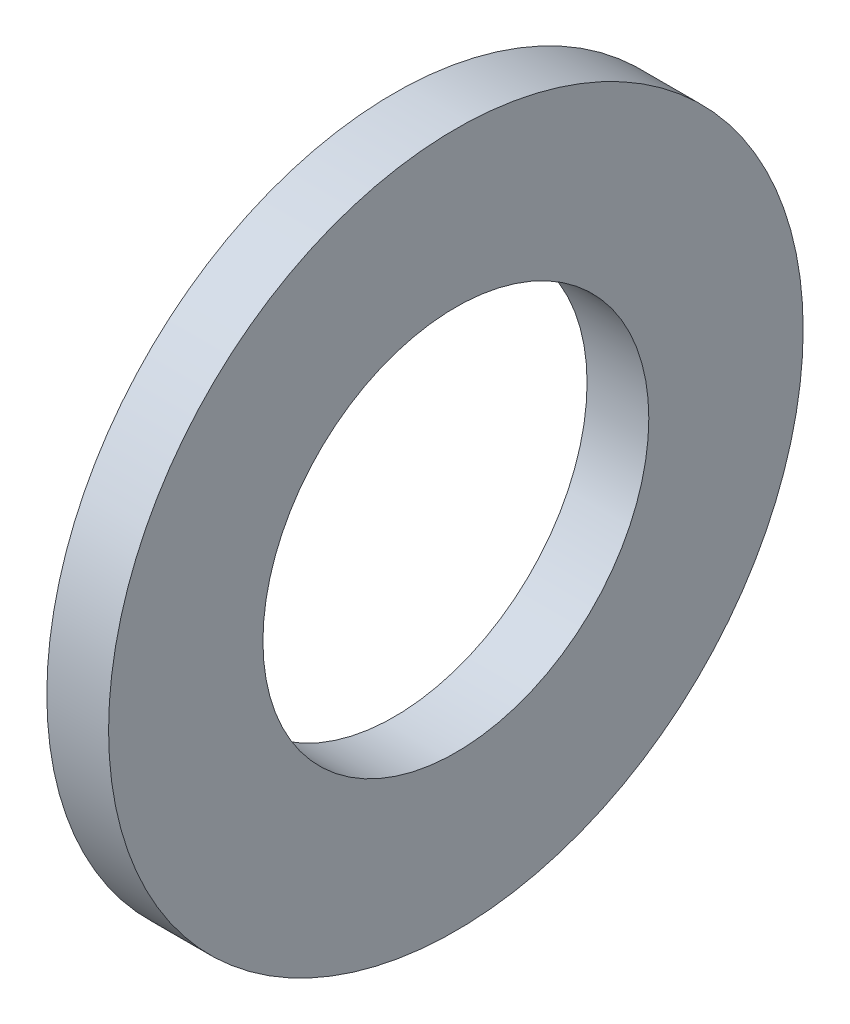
ISO-10303-21;
HEADER;
FILE_DESCRIPTION(('STEP AP214'),'2;1');
FILE_NAME('part.step','',(''),(''),'','','');
FILE_SCHEMA(('AUTOMOTIVE_DESIGN { 1 0 10303 214 1 1 1 1 }'));
ENDSEC;
DATA;
#1=APPLICATION_CONTEXT('core data for automotive mechanical design processes');
#2=APPLICATION_PROTOCOL_DEFINITION('international standard','automotive_design',2000,#1);
#3=PRODUCT_CONTEXT('',#1,'mechanical');
#4=PRODUCT('Part','Part','',(#3));
#5=PRODUCT_RELATED_PRODUCT_CATEGORY('part','',(#4));
#6=PRODUCT_DEFINITION_FORMATION('','',#4);
#7=PRODUCT_DEFINITION_CONTEXT('part definition',#1,'design');
#8=PRODUCT_DEFINITION('design','',#6,#7);
#9=PRODUCT_DEFINITION_SHAPE('','',#8);
#10=(LENGTH_UNIT() NAMED_UNIT(*) SI_UNIT(.MILLI.,.METRE.));
#11=(NAMED_UNIT(*) PLANE_ANGLE_UNIT() SI_UNIT($,.RADIAN.));
#12=(NAMED_UNIT(*) SI_UNIT($,.STERADIAN.) SOLID_ANGLE_UNIT());
#13=UNCERTAINTY_MEASURE_WITH_UNIT(LENGTH_MEASURE(1.E-05),#10,'distance_accuracy_value','');
#14=(GEOMETRIC_REPRESENTATION_CONTEXT(3) GLOBAL_UNCERTAINTY_ASSIGNED_CONTEXT((#13)) GLOBAL_UNIT_ASSIGNED_CONTEXT((#10,
#11,#12)) REPRESENTATION_CONTEXT('',''));
#15=CARTESIAN_POINT('',(0.,0.,0.));
#16=DIRECTION('',(0.,0.,1.));
#17=DIRECTION('',(1.,0.,0.));
#18=AXIS2_PLACEMENT_3D('',#15,#16,#17);
#19=CARTESIAN_POINT('',(0.,0.,0.));
#20=DIRECTION('',(1.,0.,0.));
#21=DIRECTION('',(0.,1.,0.));
#22=AXIS2_PLACEMENT_3D('',#19,#20,#21);
#23=PLANE('',#22);
#24=CARTESIAN_POINT('',(0.,0.,0.));
#25=DIRECTION('',(1.,0.,0.));
#26=DIRECTION('',(0.,0.,-1.));
#27=AXIS2_PLACEMENT_3D('',#24,#25,#26);
#28=CIRCLE('',#27,5.);
#29=CARTESIAN_POINT('',(0.,0.,-5.));
#30=VERTEX_POINT('',#29);
#31=EDGE_CURVE('E31',#30,#30,#28,.T.);
#32=ORIENTED_EDGE('',*,*,#31,.T.);
#33=EDGE_LOOP('',(#32));
#34=FACE_BOUND('',#33,.T.);
#35=CARTESIAN_POINT('',(0.,0.,0.));
#36=DIRECTION('',(1.,0.,0.));
#37=DIRECTION('',(0.,0.,-1.));
#38=AXIS2_PLACEMENT_3D('',#35,#36,#37);
#39=CIRCLE('',#38,9.);
#40=CARTESIAN_POINT('',(0.,0.,-9.));
#41=VERTEX_POINT('',#40);
#42=EDGE_CURVE('E10',#41,#41,#39,.T.);
#43=ORIENTED_EDGE('',*,*,#42,.F.);
#44=EDGE_LOOP('',(#43));
#45=FACE_BOUND('',#44,.T.);
#46=ADVANCED_FACE('F15',(#34,#45),#23,.F.);
#47=CARTESIAN_POINT('',(1.6,0.,0.));
#48=DIRECTION('',(1.,0.,0.));
#49=DIRECTION('',(0.,1.,0.));
#50=AXIS2_PLACEMENT_3D('',#47,#48,#49);
#51=PLANE('',#50);
#52=CARTESIAN_POINT('',(1.6,0.,0.));
#53=DIRECTION('',(1.,0.,0.));
#54=DIRECTION('',(0.,0.,-1.));
#55=AXIS2_PLACEMENT_3D('',#52,#53,#54);
#56=CIRCLE('',#55,5.);
#57=CARTESIAN_POINT('',(1.6,0.,-5.));
#58=VERTEX_POINT('',#57);
#59=EDGE_CURVE('E38',#58,#58,#56,.T.);
#60=ORIENTED_EDGE('',*,*,#59,.F.);
#61=EDGE_LOOP('',(#60));
#62=FACE_BOUND('',#61,.T.);
#63=CARTESIAN_POINT('',(1.6,0.,0.));
#64=DIRECTION('',(1.,0.,0.));
#65=DIRECTION('',(0.,0.,-1.));
#66=AXIS2_PLACEMENT_3D('',#63,#64,#65);
#67=CIRCLE('',#66,9.);
#68=CARTESIAN_POINT('',(1.6,0.,-9.));
#69=VERTEX_POINT('',#68);
#70=EDGE_CURVE('E22',#69,#69,#67,.T.);
#71=ORIENTED_EDGE('',*,*,#70,.T.);
#72=EDGE_LOOP('',(#71));
#73=FACE_BOUND('',#72,.T.);
#74=ADVANCED_FACE('F49',(#62,#73),#51,.T.);
#75=CARTESIAN_POINT('',(1.6,0.,0.));
#76=DIRECTION('',(-1.,0.,0.));
#77=DIRECTION('',(0.,0.,1.));
#78=AXIS2_PLACEMENT_3D('',#75,#76,#77);
#79=CYLINDRICAL_SURFACE('',#78,9.);
#80=ORIENTED_EDGE('',*,*,#42,.T.);
#81=EDGE_LOOP('',(#80));
#82=FACE_BOUND('',#81,.T.);
#83=ORIENTED_EDGE('',*,*,#70,.F.);
#84=EDGE_LOOP('',(#83));
#85=FACE_BOUND('',#84,.T.);
#86=ADVANCED_FACE('F51',(#82,#85),#79,.T.);
#87=CARTESIAN_POINT('',(1.6,0.,0.));
#88=DIRECTION('',(-1.,0.,0.));
#89=DIRECTION('',(0.,0.,1.));
#90=AXIS2_PLACEMENT_3D('',#87,#88,#89);
#91=CYLINDRICAL_SURFACE('',#90,5.);
#92=ORIENTED_EDGE('',*,*,#31,.F.);
#93=EDGE_LOOP('',(#92));
#94=FACE_BOUND('',#93,.T.);
#95=ORIENTED_EDGE('',*,*,#59,.T.);
#96=EDGE_LOOP('',(#95));
#97=FACE_BOUND('',#96,.T.);
#98=ADVANCED_FACE('F47',(#94,#97),#91,.F.);
#99=CLOSED_SHELL('',(#46,#74,#86,#98));
#100=MANIFOLD_SOLID_BREP('B1',#99);
#101=ADVANCED_BREP_SHAPE_REPRESENTATION('',(#18,#100),#14);
#102=SHAPE_DEFINITION_REPRESENTATION(#9,#101);
ENDSEC;
END-ISO-10303-21;
